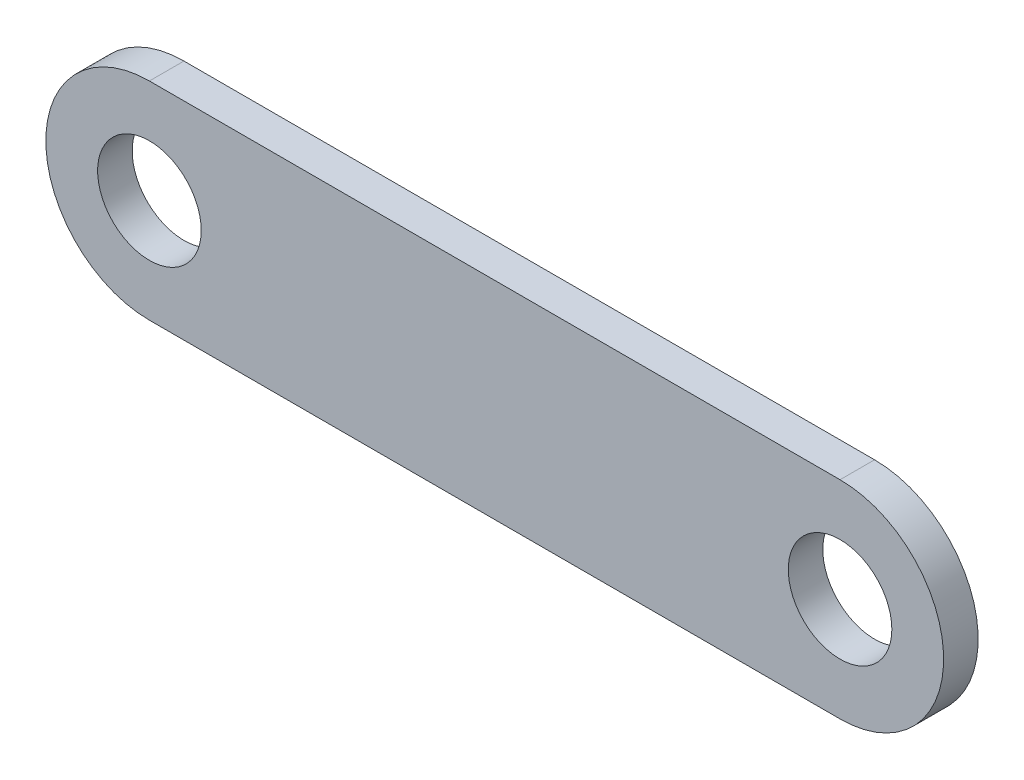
from build123d import *

# Parameters (mm, degrees)
SKETCH1_R      = 4.7625
EXTRUDE1_DEPTH = 3.175


with BuildPart() as part:
    # Sketch1 → Extrude1 (new body)
    with BuildSketch(Plane.XY):
        with BuildLine():
            Line((-31.75, 9.525), (31.75, 9.525))
            ThreePointArc((31.75, 9.525), (41.275, 0), (31.75, -9.525))
            Line((31.75, -9.525), (-31.75, -9.525))
            ThreePointArc((-31.75, -9.525), (-41.275, 0), (-31.75, 9.525))
        make_face()
        with Locations((31.75, 0)):
            Circle(SKETCH1_R, mode=Mode.SUBTRACT)
        with Locations((-31.75, 0)):
            Circle(SKETCH1_R, mode=Mode.SUBTRACT)
    extrude(amount=EXTRUDE1_DEPTH)


solid = part.part
